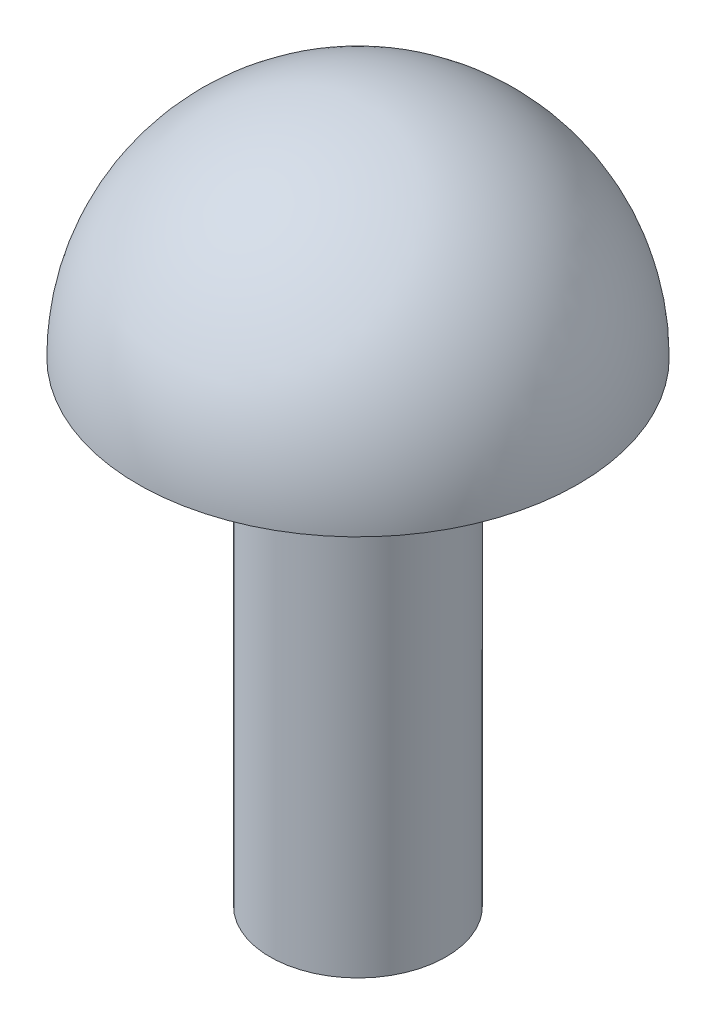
ISO-10303-21;
HEADER;
FILE_DESCRIPTION(('STEP AP214'),'2;1');
FILE_NAME('part.step','',(''),(''),'','','');
FILE_SCHEMA(('AUTOMOTIVE_DESIGN { 1 0 10303 214 1 1 1 1 }'));
ENDSEC;
DATA;
#1=APPLICATION_CONTEXT('core data for automotive mechanical design processes');
#2=APPLICATION_PROTOCOL_DEFINITION('international standard','automotive_design',2000,#1);
#3=PRODUCT_CONTEXT('',#1,'mechanical');
#4=PRODUCT('Part','Part','',(#3));
#5=PRODUCT_RELATED_PRODUCT_CATEGORY('part','',(#4));
#6=PRODUCT_DEFINITION_FORMATION('','',#4);
#7=PRODUCT_DEFINITION_CONTEXT('part definition',#1,'design');
#8=PRODUCT_DEFINITION('design','',#6,#7);
#9=PRODUCT_DEFINITION_SHAPE('','',#8);
#10=(LENGTH_UNIT() NAMED_UNIT(*) SI_UNIT(.MILLI.,.METRE.));
#11=(NAMED_UNIT(*) PLANE_ANGLE_UNIT() SI_UNIT($,.RADIAN.));
#12=(NAMED_UNIT(*) SI_UNIT($,.STERADIAN.) SOLID_ANGLE_UNIT());
#13=UNCERTAINTY_MEASURE_WITH_UNIT(LENGTH_MEASURE(1.E-05),#10,'distance_accuracy_value','');
#14=(GEOMETRIC_REPRESENTATION_CONTEXT(3) GLOBAL_UNCERTAINTY_ASSIGNED_CONTEXT((#13)) GLOBAL_UNIT_ASSIGNED_CONTEXT((#10,
#11,#12)) REPRESENTATION_CONTEXT('',''));
#15=CARTESIAN_POINT('',(0.,0.,0.));
#16=DIRECTION('',(0.,0.,1.));
#17=DIRECTION('',(1.,0.,0.));
#18=AXIS2_PLACEMENT_3D('',#15,#16,#17);
#19=CARTESIAN_POINT('',(0.,0.,0.));
#20=DIRECTION('',(0.,-1.,0.));
#21=DIRECTION('',(0.,0.,-1.));
#22=AXIS2_PLACEMENT_3D('',#19,#20,#21);
#23=PLANE('',#22);
#24=CARTESIAN_POINT('',(0.,0.,0.));
#25=DIRECTION('',(0.,-1.,0.));
#26=DIRECTION('',(0.,0.,-1.));
#27=AXIS2_PLACEMENT_3D('',#24,#25,#26);
#28=CIRCLE('',#27,1.);
#29=CARTESIAN_POINT('',(0.,0.,-1.));
#30=VERTEX_POINT('',#29);
#31=EDGE_CURVE('E10',#30,#30,#28,.T.);
#32=ORIENTED_EDGE('',*,*,#31,.T.);
#33=EDGE_LOOP('',(#32));
#34=FACE_BOUND('',#33,.T.);
#35=ADVANCED_FACE('F35',(#34),#23,.T.);
#36=CARTESIAN_POINT('',(0.,0.,0.));
#37=DIRECTION('',(0.,-1.,0.));
#38=DIRECTION('',(0.,0.,-1.));
#39=AXIS2_PLACEMENT_3D('',#36,#37,#38);
#40=CYLINDRICAL_SURFACE('',#39,1.);
#41=CARTESIAN_POINT('',(0.,5.,0.));
#42=DIRECTION('',(0.,-1.,0.));
#43=DIRECTION('',(0.,0.,-1.));
#44=AXIS2_PLACEMENT_3D('',#41,#42,#43);
#45=CIRCLE('',#44,1.);
#46=CARTESIAN_POINT('',(0.,5.,-1.));
#47=VERTEX_POINT('',#46);
#48=EDGE_CURVE('E41',#47,#47,#45,.T.);
#49=ORIENTED_EDGE('',*,*,#48,.T.);
#50=EDGE_LOOP('',(#49));
#51=FACE_BOUND('',#50,.T.);
#52=ORIENTED_EDGE('',*,*,#31,.F.);
#53=EDGE_LOOP('',(#52));
#54=FACE_BOUND('',#53,.T.);
#55=ADVANCED_FACE('F61',(#51,#54),#40,.T.);
#56=CARTESIAN_POINT('',(0.,5.,0.));
#57=DIRECTION('',(0.,1.,0.));
#58=DIRECTION('',(0.,0.,1.));
#59=AXIS2_PLACEMENT_3D('',#56,#57,#58);
#60=CONICAL_SURFACE('',#59,1.,1.31019393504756);
#61=CARTESIAN_POINT('',(0.,5.4,0.));
#62=DIRECTION('',(0.,-1.,0.));
#63=DIRECTION('',(0.,0.,-1.));
#64=AXIS2_PLACEMENT_3D('',#61,#62,#63);
#65=CIRCLE('',#64,2.5);
#66=CARTESIAN_POINT('',(0.,5.4,-2.5));
#67=VERTEX_POINT('',#66);
#68=EDGE_CURVE('E45',#67,#67,#65,.T.);
#69=ORIENTED_EDGE('',*,*,#68,.T.);
#70=EDGE_LOOP('',(#69));
#71=FACE_BOUND('',#70,.T.);
#72=ORIENTED_EDGE('',*,*,#48,.F.);
#73=EDGE_LOOP('',(#72));
#74=FACE_BOUND('',#73,.T.);
#75=ADVANCED_FACE('F52',(#71,#74),#60,.T.);
#76=CARTESIAN_POINT('',(0.,5.4,0.));
#77=DIRECTION('',(0.,-1.,0.));
#78=DIRECTION('',(1.,0.,0.));
#79=AXIS2_PLACEMENT_3D('',#76,#77,#78);
#80=SPHERICAL_SURFACE('',#79,2.5);
#81=ORIENTED_EDGE('',*,*,#68,.F.);
#82=EDGE_LOOP('',(#81));
#83=FACE_BOUND('',#82,.T.);
#84=ADVANCED_FACE('F55',(#83),#80,.T.);
#85=CLOSED_SHELL('',(#35,#55,#75,#84));
#86=MANIFOLD_SOLID_BREP('B2',#85);
#87=ADVANCED_BREP_SHAPE_REPRESENTATION('',(#18,#86),#14);
#88=SHAPE_DEFINITION_REPRESENTATION(#9,#87);
ENDSEC;
END-ISO-10303-21;
